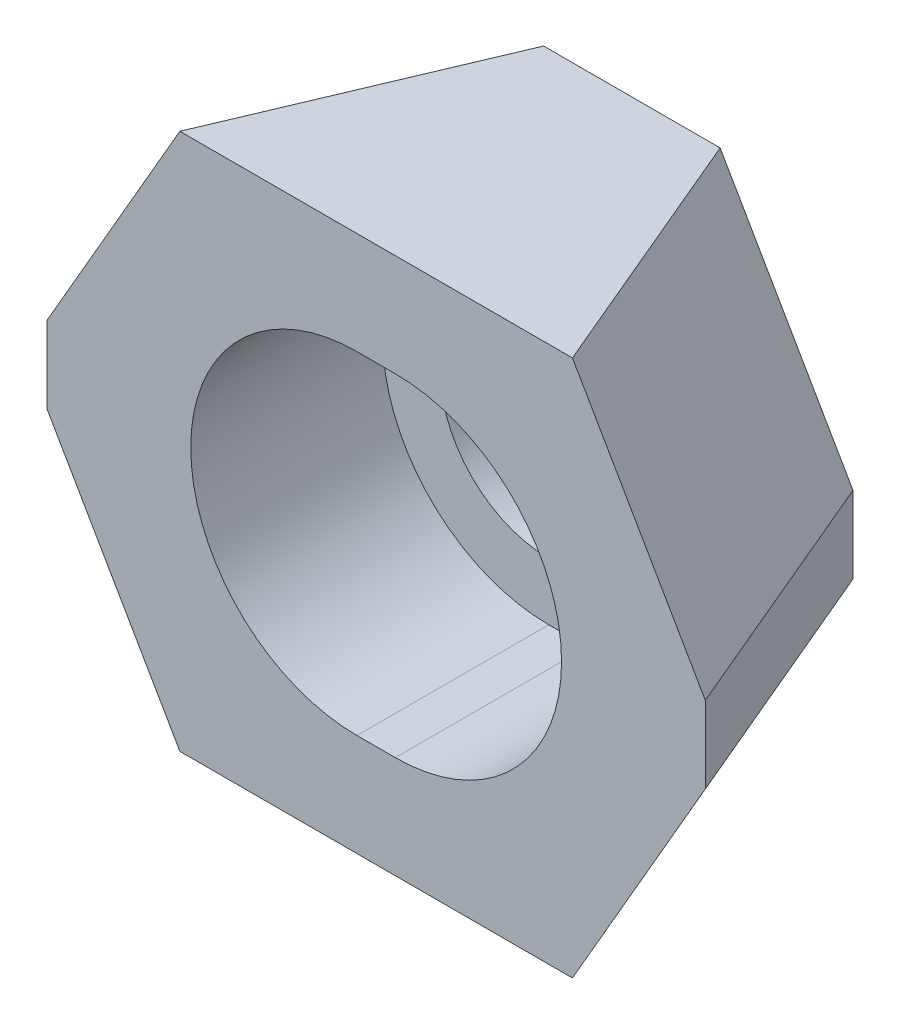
ISO-10303-21;
HEADER;
FILE_DESCRIPTION(('STEP AP214'),'2;1');
FILE_NAME('part.step','',(''),(''),'','','');
FILE_SCHEMA(('AUTOMOTIVE_DESIGN { 1 0 10303 214 1 1 1 1 }'));
ENDSEC;
DATA;
#1=APPLICATION_CONTEXT('core data for automotive mechanical design processes');
#2=APPLICATION_PROTOCOL_DEFINITION('international standard','automotive_design',2000,#1);
#3=PRODUCT_CONTEXT('',#1,'mechanical');
#4=PRODUCT('Part','Part','',(#3));
#5=PRODUCT_RELATED_PRODUCT_CATEGORY('part','',(#4));
#6=PRODUCT_DEFINITION_FORMATION('','',#4);
#7=PRODUCT_DEFINITION_CONTEXT('part definition',#1,'design');
#8=PRODUCT_DEFINITION('design','',#6,#7);
#9=PRODUCT_DEFINITION_SHAPE('','',#8);
#10=(LENGTH_UNIT() NAMED_UNIT(*) SI_UNIT(.MILLI.,.METRE.));
#11=(NAMED_UNIT(*) PLANE_ANGLE_UNIT() SI_UNIT($,.RADIAN.));
#12=(NAMED_UNIT(*) SI_UNIT($,.STERADIAN.) SOLID_ANGLE_UNIT());
#13=UNCERTAINTY_MEASURE_WITH_UNIT(LENGTH_MEASURE(1.E-05),#10,'distance_accuracy_value','');
#14=(GEOMETRIC_REPRESENTATION_CONTEXT(3) GLOBAL_UNCERTAINTY_ASSIGNED_CONTEXT((#13)) GLOBAL_UNIT_ASSIGNED_CONTEXT((#10,
#11,#12)) REPRESENTATION_CONTEXT('',''));
#15=CARTESIAN_POINT('',(0.,0.,0.));
#16=DIRECTION('',(0.,0.,1.));
#17=DIRECTION('',(1.,0.,0.));
#18=AXIS2_PLACEMENT_3D('',#15,#16,#17);
#19=CARTESIAN_POINT('',(-6.,21.,0.));
#20=DIRECTION('',(0.,1.,0.));
#21=DIRECTION('',(0.,0.,1.));
#22=AXIS2_PLACEMENT_3D('',#19,#20,#21);
#23=PLANE('',#22);
#24=DIRECTION('',(-1.,0.,0.));
#25=VECTOR('',#24,1.);
#26=CARTESIAN_POINT('',(-6.,21.,20.));
#27=LINE('',#26,#25);
#28=CARTESIAN_POINT('',(15.3512102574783,21.,20.));
#29=VERTEX_POINT('',#28);
#30=CARTESIAN_POINT('',(-15.3512102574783,21.,20.));
#31=VERTEX_POINT('',#30);
#32=EDGE_CURVE('E32',#29,#31,#27,.T.);
#33=ORIENTED_EDGE('',*,*,#32,.F.);
#34=DIRECTION('',(-0.389123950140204,0.,-0.921185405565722));
#35=VECTOR('',#34,1.);
#36=CARTESIAN_POINT('',(4.94915839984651,21.,-4.62510558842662));
#37=LINE('',#36,#35);
#38=CARTESIAN_POINT('',(6.90287949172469,21.,0.));
#39=VERTEX_POINT('',#38);
#40=EDGE_CURVE('E182',#29,#39,#37,.T.);
#41=ORIENTED_EDGE('',*,*,#40,.T.);
#42=DIRECTION('',(1.,0.,0.));
#43=VECTOR('',#42,1.);
#44=CARTESIAN_POINT('',(-6.,21.,0.));
#45=LINE('',#44,#43);
#46=CARTESIAN_POINT('',(-6.90287949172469,21.,0.));
#47=VERTEX_POINT('',#46);
#48=EDGE_CURVE('E187',#47,#39,#45,.T.);
#49=ORIENTED_EDGE('',*,*,#48,.F.);
#50=DIRECTION('',(-0.389123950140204,0.,0.921185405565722));
#51=VECTOR('',#50,1.);
#52=CARTESIAN_POINT('',(-6.7661677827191,21.,-0.323641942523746));
#53=LINE('',#52,#51);
#54=EDGE_CURVE('E177',#47,#31,#53,.T.);
#55=ORIENTED_EDGE('',*,*,#54,.T.);
#56=EDGE_LOOP('',(#33,#41,#49,#55));
#57=FACE_BOUND('',#56,.T.);
#58=ADVANCED_FACE('F14',(#57),#23,.T.);
#59=CARTESIAN_POINT('',(15.0443355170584,3.,0.));
#60=DIRECTION('',(0.,0.,-1.));
#61=DIRECTION('',(0.,1.,0.));
#62=AXIS2_PLACEMENT_3D('',#59,#60,#61);
#63=PLANE('',#62);
#64=CARTESIAN_POINT('',(1.50000000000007,0.,0.));
#65=DIRECTION('',(0.,0.,1.));
#66=DIRECTION('',(1.,0.,0.));
#67=AXIS2_PLACEMENT_3D('',#64,#65,#66);
#68=CIRCLE('',#67,8.5);
#69=CARTESIAN_POINT('',(1.50000000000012,-8.5,0.));
#70=VERTEX_POINT('',#69);
#71=CARTESIAN_POINT('',(1.50000000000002,8.5,0.));
#72=VERTEX_POINT('',#71);
#73=EDGE_CURVE('E244',#70,#72,#68,.T.);
#74=ORIENTED_EDGE('',*,*,#73,.T.);
#75=DIRECTION('',(-1.,0.,0.));
#76=VECTOR('',#75,1.);
#77=CARTESIAN_POINT('',(-1.5,8.5,0.));
#78=LINE('',#77,#76);
#79=CARTESIAN_POINT('',(-1.5,8.5,0.));
#80=VERTEX_POINT('',#79);
#81=EDGE_CURVE('E259',#72,#80,#78,.T.);
#82=ORIENTED_EDGE('',*,*,#81,.T.);
#83=CARTESIAN_POINT('',(-1.49999999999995,0.,0.));
#84=DIRECTION('',(0.,0.,1.));
#85=DIRECTION('',(1.,0.,0.));
#86=AXIS2_PLACEMENT_3D('',#83,#84,#85);
#87=CIRCLE('',#86,8.5);
#88=CARTESIAN_POINT('',(-1.4999999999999,-8.5,0.));
#89=VERTEX_POINT('',#88);
#90=EDGE_CURVE('E256',#80,#89,#87,.T.);
#91=ORIENTED_EDGE('',*,*,#90,.T.);
#92=DIRECTION('',(1.,0.,0.));
#93=VECTOR('',#92,1.);
#94=CARTESIAN_POINT('',(-1.49999999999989,-8.5,0.));
#95=LINE('',#94,#93);
#96=EDGE_CURVE('E236',#89,#70,#95,.T.);
#97=ORIENTED_EDGE('',*,*,#96,.T.);
#98=EDGE_LOOP('',(#74,#82,#91,#97));
#99=FACE_BOUND('',#98,.T.);
#100=DIRECTION('',(0.,1.,0.));
#101=VECTOR('',#100,1.);
#102=CARTESIAN_POINT('',(-17.2951843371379,3.,0.));
#103=LINE('',#102,#101);
#104=CARTESIAN_POINT('',(-17.2951843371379,-3.,0.));
#105=VERTEX_POINT('',#104);
#106=CARTESIAN_POINT('',(-17.2951843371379,3.,0.));
#107=VERTEX_POINT('',#106);
#108=EDGE_CURVE('E201',#105,#107,#103,.T.);
#109=ORIENTED_EDGE('',*,*,#108,.T.);
#110=DIRECTION('',(0.5,0.866025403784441,0.));
#111=VECTOR('',#110,1.);
#112=CARTESIAN_POINT('',(-9.21030437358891,17.0034228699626,0.));
#113=LINE('',#112,#111);
#114=EDGE_CURVE('E24',#107,#47,#113,.T.);
#115=ORIENTED_EDGE('',*,*,#114,.T.);
#116=ORIENTED_EDGE('',*,*,#48,.T.);
#117=DIRECTION('',(0.5,-0.866025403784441,0.));
#118=VECTOR('',#117,1.);
#119=CARTESIAN_POINT('',(16.732472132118,3.97464612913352,0.));
#120=LINE('',#119,#118);
#121=CARTESIAN_POINT('',(17.2951843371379,3.,0.));
#122=VERTEX_POINT('',#121);
#123=EDGE_CURVE('E195',#39,#122,#120,.T.);
#124=ORIENTED_EDGE('',*,*,#123,.T.);
#125=DIRECTION('',(0.,-1.,0.));
#126=VECTOR('',#125,1.);
#127=CARTESIAN_POINT('',(17.2951843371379,3.,0.));
#128=LINE('',#127,#126);
#129=CARTESIAN_POINT('',(17.2951843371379,-3.,0.));
#130=VERTEX_POINT('',#129);
#131=EDGE_CURVE('E192',#122,#130,#128,.T.);
#132=ORIENTED_EDGE('',*,*,#131,.T.);
#133=DIRECTION('',(-0.5,-0.866025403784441,0.));
#134=VECTOR('',#133,1.);
#135=CARTESIAN_POINT('',(19.3305483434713,0.525353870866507,0.));
#136=LINE('',#135,#134);
#137=CARTESIAN_POINT('',(6.90287949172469,-21.,0.));
#138=VERTEX_POINT('',#137);
#139=EDGE_CURVE('E174',#130,#138,#136,.T.);
#140=ORIENTED_EDGE('',*,*,#139,.T.);
#141=DIRECTION('',(1.,0.,0.));
#142=VECTOR('',#141,1.);
#143=CARTESIAN_POINT('',(-6.,-21.,0.));
#144=LINE('',#143,#142);
#145=CARTESIAN_POINT('',(-6.90287949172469,-21.,0.));
#146=VERTEX_POINT('',#145);
#147=EDGE_CURVE('E184',#146,#138,#144,.T.);
#148=ORIENTED_EDGE('',*,*,#147,.F.);
#149=DIRECTION('',(-0.5,0.866025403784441,0.));
#150=VECTOR('',#149,1.);
#151=CARTESIAN_POINT('',(-11.8083805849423,-12.5034228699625,1.04904349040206E-13));
#152=LINE('',#151,#150);
#153=EDGE_CURVE('E170',#146,#105,#152,.T.);
#154=ORIENTED_EDGE('',*,*,#153,.T.);
#155=EDGE_LOOP('',(#109,#115,#116,#124,#132,#140,#148,#154));
#156=FACE_BOUND('',#155,.T.);
#157=ADVANCED_FACE('F16',(#99,#156),#63,.T.);
#158=CARTESIAN_POINT('',(15.,-21.,22.));
#159=DIRECTION('',(0.,1.,0.));
#160=DIRECTION('',(0.,0.,1.));
#161=AXIS2_PLACEMENT_3D('',#158,#159,#160);
#162=PLANE('',#161);
#163=DIRECTION('',(-0.389123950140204,0.,-0.921185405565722));
#164=VECTOR('',#163,1.);
#165=CARTESIAN_POINT('',(16.0149415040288,-21.,21.5712719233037));
#166=LINE('',#165,#164);
#167=CARTESIAN_POINT('',(15.3512102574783,-21.,20.));
#168=VERTEX_POINT('',#167);
#169=EDGE_CURVE('E190',#168,#138,#166,.T.);
#170=ORIENTED_EDGE('',*,*,#169,.F.);
#171=DIRECTION('',(-1.,0.,0.));
#172=VECTOR('',#171,1.);
#173=CARTESIAN_POINT('',(15.,-21.,20.));
#174=LINE('',#173,#172);
#175=CARTESIAN_POINT('',(-15.3512102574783,-21.,20.));
#176=VERTEX_POINT('',#175);
#177=EDGE_CURVE('E271',#168,#176,#174,.T.);
#178=ORIENTED_EDGE('',*,*,#177,.T.);
#179=DIRECTION('',(-0.389123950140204,0.,0.921185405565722));
#180=VECTOR('',#179,1.);
#181=CARTESIAN_POINT('',(-11.4724180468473,-21.,10.8176128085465));
#182=LINE('',#181,#180);
#183=EDGE_CURVE('E198',#146,#176,#182,.T.);
#184=ORIENTED_EDGE('',*,*,#183,.F.);
#185=ORIENTED_EDGE('',*,*,#147,.T.);
#186=EDGE_LOOP('',(#170,#178,#184,#185));
#187=FACE_BOUND('',#186,.T.);
#188=ADVANCED_FACE('F308',(#187),#162,.F.);
#189=CARTESIAN_POINT('',(10.4723868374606,3.,-16.1518238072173));
#190=DIRECTION('',(0.813312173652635,0.469566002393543,-0.343556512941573));
#191=DIRECTION('',(-0.5,0.866025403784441,0.));
#192=AXIS2_PLACEMENT_3D('',#189,#190,#191);
#193=PLANE('',#192);
#194=DIRECTION('',(-0.5,0.866025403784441,0.));
#195=VECTOR('',#194,1.);
#196=CARTESIAN_POINT('',(21.9257330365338,9.61259251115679,20.));
#197=LINE('',#196,#195);
#198=CARTESIAN_POINT('',(25.7435151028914,3.,20.));
#199=VERTEX_POINT('',#198);
#200=EDGE_CURVE('E266',#199,#29,#197,.T.);
#201=ORIENTED_EDGE('',*,*,#200,.F.);
#202=DIRECTION('',(-0.389123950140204,0.,-0.921185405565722));
#203=VECTOR('',#202,1.);
#204=CARTESIAN_POINT('',(22.8933048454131,3.,13.2526073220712));
#205=LINE('',#204,#203);
#206=EDGE_CURVE('E18',#199,#122,#205,.T.);
#207=ORIENTED_EDGE('',*,*,#206,.T.);
#208=ORIENTED_EDGE('',*,*,#123,.F.);
#209=ORIENTED_EDGE('',*,*,#40,.F.);
#210=EDGE_LOOP('',(#201,#207,#208,#209));
#211=FACE_BOUND('',#210,.T.);
#212=ADVANCED_FACE('F313',(#211),#193,.T.);
#213=CARTESIAN_POINT('',(10.4723868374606,-3.,-16.1518238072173));
#214=DIRECTION('',(0.813312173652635,-0.469566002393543,-0.343556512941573));
#215=DIRECTION('',(-0.5,-0.866025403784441,0.));
#216=AXIS2_PLACEMENT_3D('',#213,#214,#215);
#217=PLANE('',#216);
#218=DIRECTION('',(0.5,0.866025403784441,0.));
#219=VECTOR('',#218,1.);
#220=CARTESIAN_POINT('',(21.9257330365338,-9.6125925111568,20.));
#221=LINE('',#220,#219);
#222=CARTESIAN_POINT('',(25.7435151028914,-3.,20.));
#223=VERTEX_POINT('',#222);
#224=EDGE_CURVE('E40',#168,#223,#221,.T.);
#225=ORIENTED_EDGE('',*,*,#224,.F.);
#226=ORIENTED_EDGE('',*,*,#169,.T.);
#227=ORIENTED_EDGE('',*,*,#139,.F.);
#228=DIRECTION('',(-0.389123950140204,0.,-0.921185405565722));
#229=VECTOR('',#228,1.);
#230=CARTESIAN_POINT('',(22.8933048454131,-3.,13.2526073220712));
#231=LINE('',#230,#229);
#232=EDGE_CURVE('E172',#223,#130,#231,.T.);
#233=ORIENTED_EDGE('',*,*,#232,.F.);
#234=EDGE_LOOP('',(#225,#226,#227,#233));
#235=FACE_BOUND('',#234,.T.);
#236=ADVANCED_FACE('F318',(#235),#217,.T.);
#237=CARTESIAN_POINT('',(22.8933048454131,0.,13.2526073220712));
#238=DIRECTION('',(0.921185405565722,0.,-0.389123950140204));
#239=DIRECTION('',(0.389123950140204,0.,0.921185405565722));
#240=AXIS2_PLACEMENT_3D('',#237,#238,#239);
#241=PLANE('',#240);
#242=DIRECTION('',(0.,1.,0.));
#243=VECTOR('',#242,1.);
#244=CARTESIAN_POINT('',(25.7435151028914,0.,20.));
#245=LINE('',#244,#243);
#246=EDGE_CURVE('E253',#223,#199,#245,.T.);
#247=ORIENTED_EDGE('',*,*,#246,.F.);
#248=ORIENTED_EDGE('',*,*,#232,.T.);
#249=ORIENTED_EDGE('',*,*,#131,.F.);
#250=ORIENTED_EDGE('',*,*,#206,.F.);
#251=EDGE_LOOP('',(#247,#248,#249,#250));
#252=FACE_BOUND('',#251,.T.);
#253=ADVANCED_FACE('F315',(#252),#241,.T.);
#254=CARTESIAN_POINT('',(-10.4723868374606,3.,-16.1518238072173));
#255=DIRECTION('',(-0.813312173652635,0.469566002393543,-0.343556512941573));
#256=DIRECTION('',(0.5,0.866025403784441,0.));
#257=AXIS2_PLACEMENT_3D('',#254,#255,#256);
#258=PLANE('',#257);
#259=DIRECTION('',(-0.5,-0.866025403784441,0.));
#260=VECTOR('',#259,1.);
#261=CARTESIAN_POINT('',(-21.9257330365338,9.61259251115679,20.));
#262=LINE('',#261,#260);
#263=CARTESIAN_POINT('',(-25.7435151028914,3.,20.));
#264=VERTEX_POINT('',#263);
#265=EDGE_CURVE('E215',#31,#264,#262,.T.);
#266=ORIENTED_EDGE('',*,*,#265,.F.);
#267=ORIENTED_EDGE('',*,*,#54,.F.);
#268=ORIENTED_EDGE('',*,*,#114,.F.);
#269=DIRECTION('',(0.389123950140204,0.,-0.921185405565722));
#270=VECTOR('',#269,1.);
#271=CARTESIAN_POINT('',(-22.8933048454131,3.,13.2526073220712));
#272=LINE('',#271,#270);
#273=EDGE_CURVE('E171',#264,#107,#272,.T.);
#274=ORIENTED_EDGE('',*,*,#273,.F.);
#275=EDGE_LOOP('',(#266,#267,#268,#274));
#276=FACE_BOUND('',#275,.T.);
#277=ADVANCED_FACE('F213',(#276),#258,.T.);
#278=CARTESIAN_POINT('',(-10.4723868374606,-3.,-16.1518238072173));
#279=DIRECTION('',(-0.813312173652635,-0.469566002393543,-0.343556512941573));
#280=DIRECTION('',(0.5,-0.866025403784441,0.));
#281=AXIS2_PLACEMENT_3D('',#278,#279,#280);
#282=PLANE('',#281);
#283=DIRECTION('',(0.5,-0.866025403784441,0.));
#284=VECTOR('',#283,1.);
#285=CARTESIAN_POINT('',(-21.9257330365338,-9.6125925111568,20.));
#286=LINE('',#285,#284);
#287=CARTESIAN_POINT('',(-25.7435151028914,-3.,20.));
#288=VERTEX_POINT('',#287);
#289=EDGE_CURVE('E274',#288,#176,#286,.T.);
#290=ORIENTED_EDGE('',*,*,#289,.F.);
#291=DIRECTION('',(0.389123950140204,0.,-0.921185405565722));
#292=VECTOR('',#291,1.);
#293=CARTESIAN_POINT('',(-22.8933048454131,-3.,13.2526073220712));
#294=LINE('',#293,#292);
#295=EDGE_CURVE('E168',#288,#105,#294,.T.);
#296=ORIENTED_EDGE('',*,*,#295,.T.);
#297=ORIENTED_EDGE('',*,*,#153,.F.);
#298=ORIENTED_EDGE('',*,*,#183,.T.);
#299=EDGE_LOOP('',(#290,#296,#297,#298));
#300=FACE_BOUND('',#299,.T.);
#301=ADVANCED_FACE('F327',(#300),#282,.T.);
#302=CARTESIAN_POINT('',(-22.8933048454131,0.,13.2526073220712));
#303=DIRECTION('',(-0.921185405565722,0.,-0.389123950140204));
#304=DIRECTION('',(-0.389123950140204,0.,0.921185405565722));
#305=AXIS2_PLACEMENT_3D('',#302,#303,#304);
#306=PLANE('',#305);
#307=DIRECTION('',(0.,-1.,0.));
#308=VECTOR('',#307,1.);
#309=CARTESIAN_POINT('',(-25.7435151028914,0.,20.));
#310=LINE('',#309,#308);
#311=EDGE_CURVE('E146',#264,#288,#310,.T.);
#312=ORIENTED_EDGE('',*,*,#311,.F.);
#313=ORIENTED_EDGE('',*,*,#273,.T.);
#314=ORIENTED_EDGE('',*,*,#108,.F.);
#315=ORIENTED_EDGE('',*,*,#295,.F.);
#316=EDGE_LOOP('',(#312,#313,#314,#315));
#317=FACE_BOUND('',#316,.T.);
#318=ADVANCED_FACE('F220',(#317),#306,.T.);
#319=CARTESIAN_POINT('',(-1.5,0.,5.));
#320=DIRECTION('',(0.,0.,1.));
#321=DIRECTION('',(1.,0.,0.));
#322=AXIS2_PLACEMENT_3D('',#319,#320,#321);
#323=CYLINDRICAL_SURFACE('',#322,13.);
#324=DIRECTION('',(0.,0.,1.));
#325=VECTOR('',#324,1.);
#326=CARTESIAN_POINT('',(-1.5,13.,5.));
#327=LINE('',#326,#325);
#328=CARTESIAN_POINT('',(-1.5,13.,5.));
#329=VERTEX_POINT('',#328);
#330=CARTESIAN_POINT('',(-1.5,13.,20.));
#331=VERTEX_POINT('',#330);
#332=EDGE_CURVE('E145',#329,#331,#327,.T.);
#333=ORIENTED_EDGE('',*,*,#332,.T.);
#334=CARTESIAN_POINT('',(-1.5,0.,20.));
#335=DIRECTION('',(0.,0.,-1.));
#336=DIRECTION('',(0.,1.,0.));
#337=AXIS2_PLACEMENT_3D('',#334,#335,#336);
#338=CIRCLE('',#337,13.);
#339=CARTESIAN_POINT('',(-1.5,-13.,20.));
#340=VERTEX_POINT('',#339);
#341=EDGE_CURVE('E132',#331,#340,#338,.F.);
#342=ORIENTED_EDGE('',*,*,#341,.T.);
#343=DIRECTION('',(0.,0.,1.));
#344=VECTOR('',#343,1.);
#345=CARTESIAN_POINT('',(-1.5,-13.,5.));
#346=LINE('',#345,#344);
#347=CARTESIAN_POINT('',(-1.5,-13.,5.));
#348=VERTEX_POINT('',#347);
#349=EDGE_CURVE('E143',#348,#340,#346,.T.);
#350=ORIENTED_EDGE('',*,*,#349,.F.);
#351=CARTESIAN_POINT('',(-1.5,0.,5.));
#352=DIRECTION('',(0.,0.,1.));
#353=DIRECTION('',(1.,0.,0.));
#354=AXIS2_PLACEMENT_3D('',#351,#352,#353);
#355=CIRCLE('',#354,13.);
#356=EDGE_CURVE('E229',#329,#348,#355,.T.);
#357=ORIENTED_EDGE('',*,*,#356,.F.);
#358=EDGE_LOOP('',(#333,#342,#350,#357));
#359=FACE_BOUND('',#358,.T.);
#360=ADVANCED_FACE('F141',(#359),#323,.F.);
#361=CARTESIAN_POINT('',(-1.5,13.,5.));
#362=DIRECTION('',(0.,1.,0.));
#363=DIRECTION('',(0.,0.,1.));
#364=AXIS2_PLACEMENT_3D('',#361,#362,#363);
#365=PLANE('',#364);
#366=DIRECTION('',(0.,0.,1.));
#367=VECTOR('',#366,1.);
#368=CARTESIAN_POINT('',(1.5,13.,5.));
#369=LINE('',#368,#367);
#370=CARTESIAN_POINT('',(1.5,13.,5.));
#371=VERTEX_POINT('',#370);
#372=CARTESIAN_POINT('',(1.5,13.,20.));
#373=VERTEX_POINT('',#372);
#374=EDGE_CURVE('E156',#371,#373,#369,.T.);
#375=ORIENTED_EDGE('',*,*,#374,.T.);
#376=DIRECTION('',(-1.,0.,0.));
#377=VECTOR('',#376,1.);
#378=CARTESIAN_POINT('',(-1.5,13.,20.));
#379=LINE('',#378,#377);
#380=EDGE_CURVE('E147',#373,#331,#379,.T.);
#381=ORIENTED_EDGE('',*,*,#380,.T.);
#382=ORIENTED_EDGE('',*,*,#332,.F.);
#383=DIRECTION('',(-1.,0.,0.));
#384=VECTOR('',#383,1.);
#385=CARTESIAN_POINT('',(-1.5,13.,5.));
#386=LINE('',#385,#384);
#387=EDGE_CURVE('E154',#371,#329,#386,.T.);
#388=ORIENTED_EDGE('',*,*,#387,.F.);
#389=EDGE_LOOP('',(#375,#381,#382,#388));
#390=FACE_BOUND('',#389,.T.);
#391=ADVANCED_FACE('F284',(#390),#365,.F.);
#392=CARTESIAN_POINT('',(1.5,0.,5.));
#393=DIRECTION('',(0.,0.,1.));
#394=DIRECTION('',(1.,0.,0.));
#395=AXIS2_PLACEMENT_3D('',#392,#393,#394);
#396=CYLINDRICAL_SURFACE('',#395,13.);
#397=DIRECTION('',(0.,0.,1.));
#398=VECTOR('',#397,1.);
#399=CARTESIAN_POINT('',(1.5,-13.,5.));
#400=LINE('',#399,#398);
#401=CARTESIAN_POINT('',(1.5,-13.,5.));
#402=VERTEX_POINT('',#401);
#403=CARTESIAN_POINT('',(1.5,-13.,20.));
#404=VERTEX_POINT('',#403);
#405=EDGE_CURVE('E153',#402,#404,#400,.T.);
#406=ORIENTED_EDGE('',*,*,#405,.T.);
#407=CARTESIAN_POINT('',(1.5,0.,20.));
#408=DIRECTION('',(0.,0.,-1.));
#409=DIRECTION('',(0.,1.,0.));
#410=AXIS2_PLACEMENT_3D('',#407,#408,#409);
#411=CIRCLE('',#410,13.);
#412=EDGE_CURVE('E135',#404,#373,#411,.F.);
#413=ORIENTED_EDGE('',*,*,#412,.T.);
#414=ORIENTED_EDGE('',*,*,#374,.F.);
#415=CARTESIAN_POINT('',(1.5,0.,5.));
#416=DIRECTION('',(0.,0.,1.));
#417=DIRECTION('',(1.,0.,0.));
#418=AXIS2_PLACEMENT_3D('',#415,#416,#417);
#419=CIRCLE('',#418,13.);
#420=EDGE_CURVE('E159',#402,#371,#419,.T.);
#421=ORIENTED_EDGE('',*,*,#420,.F.);
#422=EDGE_LOOP('',(#406,#413,#414,#421));
#423=FACE_BOUND('',#422,.T.);
#424=ADVANCED_FACE('F280',(#423),#396,.F.);
#425=CARTESIAN_POINT('',(-1.5,-13.,5.));
#426=DIRECTION('',(0.,-1.,0.));
#427=DIRECTION('',(0.,0.,-1.));
#428=AXIS2_PLACEMENT_3D('',#425,#426,#427);
#429=PLANE('',#428);
#430=ORIENTED_EDGE('',*,*,#349,.T.);
#431=DIRECTION('',(1.,0.,0.));
#432=VECTOR('',#431,1.);
#433=CARTESIAN_POINT('',(-1.5,-13.,20.));
#434=LINE('',#433,#432);
#435=EDGE_CURVE('E9',#340,#404,#434,.T.);
#436=ORIENTED_EDGE('',*,*,#435,.T.);
#437=ORIENTED_EDGE('',*,*,#405,.F.);
#438=DIRECTION('',(1.,0.,0.));
#439=VECTOR('',#438,1.);
#440=CARTESIAN_POINT('',(-1.5,-13.,5.));
#441=LINE('',#440,#439);
#442=EDGE_CURVE('E151',#348,#402,#441,.T.);
#443=ORIENTED_EDGE('',*,*,#442,.F.);
#444=EDGE_LOOP('',(#430,#436,#437,#443));
#445=FACE_BOUND('',#444,.T.);
#446=ADVANCED_FACE('F149',(#445),#429,.F.);
#447=CARTESIAN_POINT('',(-1.5,0.,5.));
#448=DIRECTION('',(0.,0.,1.));
#449=DIRECTION('',(1.,0.,0.));
#450=AXIS2_PLACEMENT_3D('',#447,#448,#449);
#451=PLANE('',#450);
#452=CARTESIAN_POINT('',(1.50000000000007,0.,5.));
#453=DIRECTION('',(0.,0.,1.));
#454=DIRECTION('',(1.,0.,0.));
#455=AXIS2_PLACEMENT_3D('',#452,#453,#454);
#456=CIRCLE('',#455,8.5);
#457=CARTESIAN_POINT('',(1.50000000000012,-8.5,5.));
#458=VERTEX_POINT('',#457);
#459=CARTESIAN_POINT('',(1.5,8.5,5.));
#460=VERTEX_POINT('',#459);
#461=EDGE_CURVE('E251',#458,#460,#456,.T.);
#462=ORIENTED_EDGE('',*,*,#461,.F.);
#463=DIRECTION('',(1.,0.,0.));
#464=VECTOR('',#463,1.);
#465=CARTESIAN_POINT('',(-1.49999999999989,-8.5,5.));
#466=LINE('',#465,#464);
#467=CARTESIAN_POINT('',(-1.4999999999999,-8.5,5.));
#468=VERTEX_POINT('',#467);
#469=EDGE_CURVE('E241',#468,#458,#466,.T.);
#470=ORIENTED_EDGE('',*,*,#469,.F.);
#471=CARTESIAN_POINT('',(-1.49999999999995,0.,5.));
#472=DIRECTION('',(0.,0.,1.));
#473=DIRECTION('',(1.,0.,0.));
#474=AXIS2_PLACEMENT_3D('',#471,#472,#473);
#475=CIRCLE('',#474,8.5);
#476=CARTESIAN_POINT('',(-1.5,8.5,5.));
#477=VERTEX_POINT('',#476);
#478=EDGE_CURVE('E245',#477,#468,#475,.T.);
#479=ORIENTED_EDGE('',*,*,#478,.F.);
#480=DIRECTION('',(-1.,0.,0.));
#481=VECTOR('',#480,1.);
#482=CARTESIAN_POINT('',(-1.5,8.5,5.));
#483=LINE('',#482,#481);
#484=EDGE_CURVE('E248',#460,#477,#483,.T.);
#485=ORIENTED_EDGE('',*,*,#484,.F.);
#486=EDGE_LOOP('',(#462,#470,#479,#485));
#487=FACE_BOUND('',#486,.T.);
#488=ORIENTED_EDGE('',*,*,#356,.T.);
#489=ORIENTED_EDGE('',*,*,#442,.T.);
#490=ORIENTED_EDGE('',*,*,#420,.T.);
#491=ORIENTED_EDGE('',*,*,#387,.T.);
#492=EDGE_LOOP('',(#488,#489,#490,#491));
#493=FACE_BOUND('',#492,.T.);
#494=ADVANCED_FACE('F286',(#487,#493),#451,.T.);
#495=CARTESIAN_POINT('',(1.50000000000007,0.,0.));
#496=DIRECTION('',(0.,0.,1.));
#497=DIRECTION('',(1.,0.,0.));
#498=AXIS2_PLACEMENT_3D('',#495,#496,#497);
#499=CYLINDRICAL_SURFACE('',#498,8.5);
#500=ORIENTED_EDGE('',*,*,#461,.T.);
#501=DIRECTION('',(0.,0.,1.));
#502=VECTOR('',#501,1.);
#503=CARTESIAN_POINT('',(1.50000000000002,8.5,0.));
#504=LINE('',#503,#502);
#505=EDGE_CURVE('E232',#72,#460,#504,.T.);
#506=ORIENTED_EDGE('',*,*,#505,.F.);
#507=ORIENTED_EDGE('',*,*,#73,.F.);
#508=DIRECTION('',(0.,0.,1.));
#509=VECTOR('',#508,1.);
#510=CARTESIAN_POINT('',(1.50000000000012,-8.5,0.));
#511=LINE('',#510,#509);
#512=EDGE_CURVE('E231',#70,#458,#511,.T.);
#513=ORIENTED_EDGE('',*,*,#512,.T.);
#514=EDGE_LOOP('',(#500,#506,#507,#513));
#515=FACE_BOUND('',#514,.T.);
#516=ADVANCED_FACE('F288',(#515),#499,.F.);
#517=CARTESIAN_POINT('',(-1.49999999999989,-8.5,0.));
#518=DIRECTION('',(0.,-1.,0.));
#519=DIRECTION('',(1.,0.,0.));
#520=AXIS2_PLACEMENT_3D('',#517,#518,#519);
#521=PLANE('',#520);
#522=ORIENTED_EDGE('',*,*,#469,.T.);
#523=ORIENTED_EDGE('',*,*,#512,.F.);
#524=ORIENTED_EDGE('',*,*,#96,.F.);
#525=DIRECTION('',(0.,0.,1.));
#526=VECTOR('',#525,1.);
#527=CARTESIAN_POINT('',(-1.4999999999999,-8.5,0.));
#528=LINE('',#527,#526);
#529=EDGE_CURVE('E238',#89,#468,#528,.T.);
#530=ORIENTED_EDGE('',*,*,#529,.T.);
#531=EDGE_LOOP('',(#522,#523,#524,#530));
#532=FACE_BOUND('',#531,.T.);
#533=ADVANCED_FACE('F297',(#532),#521,.F.);
#534=CARTESIAN_POINT('',(-1.49999999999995,0.,0.));
#535=DIRECTION('',(0.,0.,1.));
#536=DIRECTION('',(1.,0.,0.));
#537=AXIS2_PLACEMENT_3D('',#534,#535,#536);
#538=CYLINDRICAL_SURFACE('',#537,8.5);
#539=ORIENTED_EDGE('',*,*,#478,.T.);
#540=ORIENTED_EDGE('',*,*,#529,.F.);
#541=ORIENTED_EDGE('',*,*,#90,.F.);
#542=DIRECTION('',(0.,0.,1.));
#543=VECTOR('',#542,1.);
#544=CARTESIAN_POINT('',(-1.5,8.5,0.));
#545=LINE('',#544,#543);
#546=EDGE_CURVE('E235',#80,#477,#545,.T.);
#547=ORIENTED_EDGE('',*,*,#546,.T.);
#548=EDGE_LOOP('',(#539,#540,#541,#547));
#549=FACE_BOUND('',#548,.T.);
#550=ADVANCED_FACE('F433',(#549),#538,.F.);
#551=CARTESIAN_POINT('',(-1.5,8.5,0.));
#552=DIRECTION('',(0.,1.,0.));
#553=DIRECTION('',(-1.,0.,0.));
#554=AXIS2_PLACEMENT_3D('',#551,#552,#553);
#555=PLANE('',#554);
#556=ORIENTED_EDGE('',*,*,#484,.T.);
#557=ORIENTED_EDGE('',*,*,#546,.F.);
#558=ORIENTED_EDGE('',*,*,#81,.F.);
#559=ORIENTED_EDGE('',*,*,#505,.T.);
#560=EDGE_LOOP('',(#556,#557,#558,#559));
#561=FACE_BOUND('',#560,.T.);
#562=ADVANCED_FACE('F441',(#561),#555,.F.);
#563=CARTESIAN_POINT('',(97.6840686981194,48.3868557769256,20.));
#564=DIRECTION('',(0.,0.,-1.));
#565=DIRECTION('',(0.,1.,0.));
#566=AXIS2_PLACEMENT_3D('',#563,#564,#565);
#567=PLANE('',#566);
#568=ORIENTED_EDGE('',*,*,#224,.T.);
#569=ORIENTED_EDGE('',*,*,#246,.T.);
#570=ORIENTED_EDGE('',*,*,#200,.T.);
#571=ORIENTED_EDGE('',*,*,#32,.T.);
#572=ORIENTED_EDGE('',*,*,#265,.T.);
#573=ORIENTED_EDGE('',*,*,#311,.T.);
#574=ORIENTED_EDGE('',*,*,#289,.T.);
#575=ORIENTED_EDGE('',*,*,#177,.F.);
#576=EDGE_LOOP('',(#568,#569,#570,#571,#572,#573,#574,#575));
#577=FACE_BOUND('',#576,.T.);
#578=ORIENTED_EDGE('',*,*,#341,.F.);
#579=ORIENTED_EDGE('',*,*,#380,.F.);
#580=ORIENTED_EDGE('',*,*,#412,.F.);
#581=ORIENTED_EDGE('',*,*,#435,.F.);
#582=EDGE_LOOP('',(#578,#579,#580,#581));
#583=FACE_BOUND('',#582,.T.);
#584=ADVANCED_FACE('F131',(#577,#583),#567,.F.);
#585=CLOSED_SHELL('',(#58,#157,#188,#212,#236,#253,#277,#301,#318,#360,#391,#424,#446,#494,#516,
#533,#550,#562,#584));
#586=MANIFOLD_SOLID_BREP('B1',#585);
#587=ADVANCED_BREP_SHAPE_REPRESENTATION('',(#18,#586),#14);
#588=SHAPE_DEFINITION_REPRESENTATION(#9,#587);
ENDSEC;
END-ISO-10303-21;
